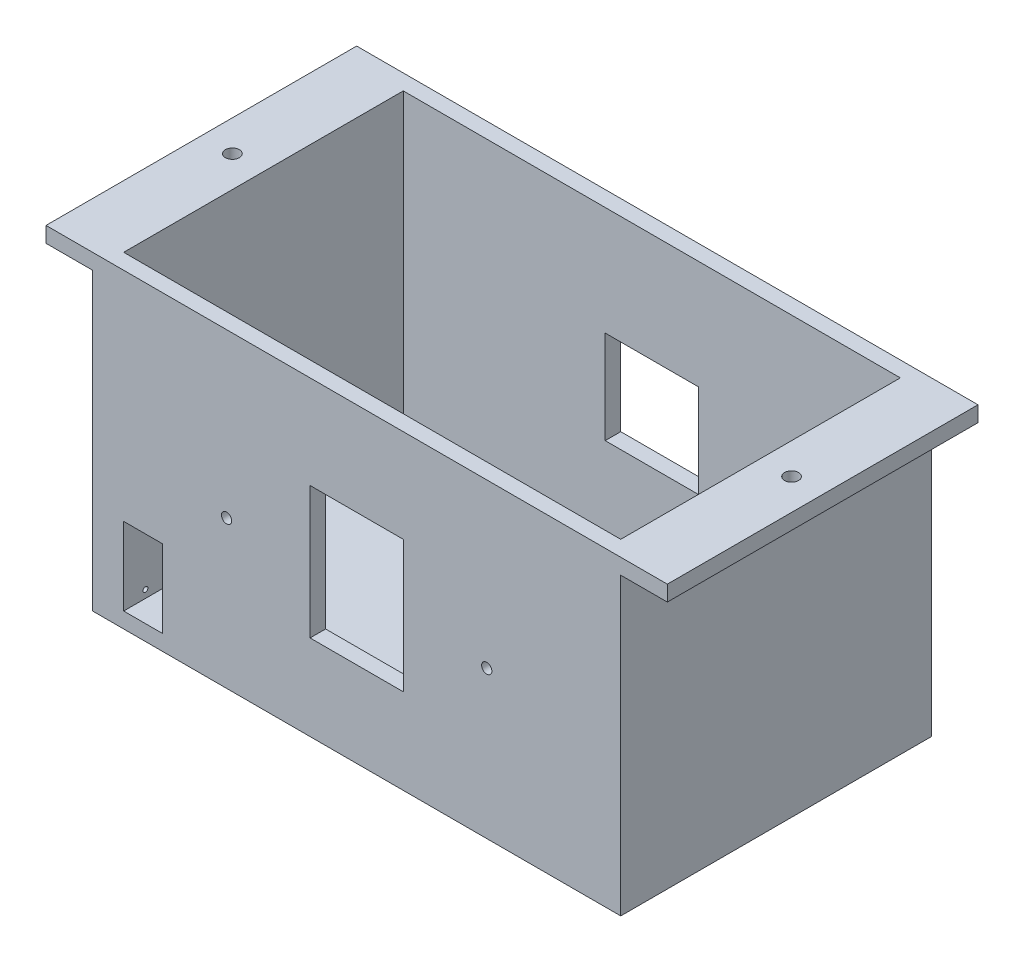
from build123d import *

# Parameters (mm, degrees)
SKETCH1_W                       = 200
SKETCH1_H                       = 100
BOSS_EXTRUDE1_DEPTH             = 100
SKETCH2_W                       = 160
SKETCH2_H                       = 90
CUT_EXTRUDE1_DEPTH              = 95
SKETCH3_W                       = 15
SKETCH3_H                       = 100
CUT_EXTRUDE2_DEPTH              = 95
F_16_0_177_DIAMETER_HOLE1_D     = 4.4958
TAP_DRILL_FOR_M4X0_7_TAP1_D     = 3.3
TAP_DRILL_FOR_M4X0_7_TAP1_DEPTH = 5
SKETCH13_W                      = 30
SKETCH13_H                      = 40
CUT_EXTRUDE5_DEPTH              = 10
SKETCH12_W                      = 30
SKETCH12_H                      = 40
CUT_EXTRUDE4_DEPTH              = 10
SKETCH16_W                      = 45
SKETCH16_H                      = 25
BOSS_EXTRUDE4_DEPTH             = 5
SKETCH18_W                      = 12.5
SKETCH18_H                      = 25
CUT_EXTRUDE6_DEPTH              = 5
TAP_DRILL_FOR_M2X0_4_TAP1_D     = 1.6
TAP_DRILL_FOR_M2X0_4_TAP1_DEPTH = 10
SKETCH21_W                      = 30
SKETCH21_H                      = 30
CUT_EXTRUDE7_DEPTH              = 10


with BuildPart() as part:
    # Sketch1 → Boss-Extrude1 (new body)
    with BuildSketch(Plane(origin=(0, 0, 0), x_dir=(1, 0, 0), z_dir=(0, 1, 0))):
        with Locations((31.517039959, -13.347148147)):
            Rectangle(SKETCH1_W, SKETCH1_H)
    extrude(amount=BOSS_EXTRUDE1_DEPTH)

    # Sketch2 → Cut-Extrude1 (cut)
    with BuildSketch(Plane(origin=(0, 100, 0), x_dir=(1, 0, 0), z_dir=(0, 1, 0))):
        with Locations((31.517039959, -13.347148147)):
            Rectangle(SKETCH2_W, SKETCH2_H)
    extrude(amount=-CUT_EXTRUDE1_DEPTH, mode=Mode.SUBTRACT)

    # Sketch3 → Cut-Extrude2 (cut)
    with BuildSketch(Plane.XZ):
        with Locations((-60.982960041, 13.347148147)):
            Rectangle(SKETCH3_W, SKETCH3_H)
        with Locations((124.017039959, 13.347148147)):
            Rectangle(SKETCH3_W, SKETCH3_H)
    extrude(amount=-CUT_EXTRUDE2_DEPTH, mode=Mode.SUBTRACT)

    # 16 _0.177_ Diameter Hole1 (through all)
    with Locations(Plane(origin=(0, 100, 0), x_dir=(1, 0, 0), z_dir=(0, 1, 0))):
        with Locations((-58.482960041, -13.347148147), (121.517039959, -13.347148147)):
            Hole(F_16_0_177_DIAMETER_HOLE1_D / 2)

    # Tap Drill for M4x0.7 Tap1
    with Locations(Plane.XY.offset(63.347148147)):
        with Locations((-10.357960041, 47.5), (73.392039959, 47.5)):
            Hole(TAP_DRILL_FOR_M4X0_7_TAP1_D / 2, depth=TAP_DRILL_FOR_M4X0_7_TAP1_DEPTH)

    # Sketch13 → Cut-Extrude5 (cut)
    with BuildSketch(Plane.XY.offset(63.347148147)):
        with Locations((31.517039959, 47.5)):
            Rectangle(SKETCH13_W, SKETCH13_H)
    extrude(amount=-CUT_EXTRUDE5_DEPTH, mode=Mode.SUBTRACT)

    # Sketch12 → Cut-Extrude4 (cut)
    with BuildSketch(Plane.XY.offset(63.347148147)):
        with Locations((31.517039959, 50)):
            Rectangle(SKETCH12_W, SKETCH12_H)
    extrude(amount=-CUT_EXTRUDE4_DEPTH, mode=Mode.SUBTRACT)

    # Sketch16 → Boss-Extrude4 (add)
    with BuildSketch(Plane(origin=(-48.482960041, 0, 0), x_dir=(0, 0, -1), z_dir=(1, 0, 0))):
        with Locations((-35.847148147, 17.5)):
            Rectangle(SKETCH16_W, SKETCH16_H)
    extrude(amount=BOSS_EXTRUDE4_DEPTH)

    # Sketch18 → Cut-Extrude6 (cut)
    with BuildSketch(Plane.XY.offset(63.347148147)):
        with Locations((-37.232960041, 17.5)):
            Rectangle(SKETCH18_W, SKETCH18_H)
    extrude(amount=-CUT_EXTRUDE6_DEPTH, mode=Mode.SUBTRACT)

    # Tap Drill for M2x0.4 Tap1
    with Locations(Plane(origin=(-43.482960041, 0, 0), x_dir=(0, 0, -1), z_dir=(1, 0, 0))):
        with Locations((-56.347148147, 27), (-18.347148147, 27), (-18.347148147, 7.5), (-56.347148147, 7.5)):
            Hole(TAP_DRILL_FOR_M2X0_4_TAP1_D / 2, depth=TAP_DRILL_FOR_M2X0_4_TAP1_DEPTH)

    # Sketch21 → Cut-Extrude7 (cut)
    with BuildSketch(Plane(origin=(0, 0, -36.652851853), x_dir=(-1, 0, 0), z_dir=(0, 0, -1))):
        with Locations((-31.517039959, 50)):
            Rectangle(SKETCH21_W, SKETCH21_H)
    extrude(amount=-CUT_EXTRUDE7_DEPTH, mode=Mode.SUBTRACT)


solid = part.part
